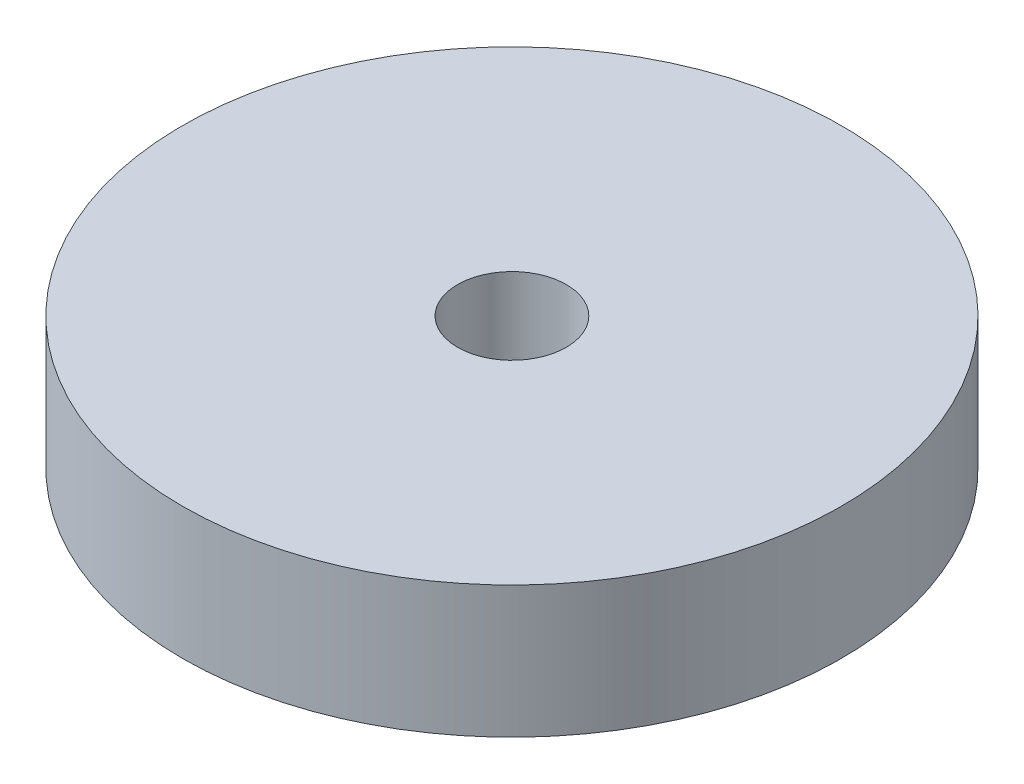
ISO-10303-21;
HEADER;
FILE_DESCRIPTION(('STEP AP214'),'2;1');
FILE_NAME('part.step','',(''),(''),'','','');
FILE_SCHEMA(('AUTOMOTIVE_DESIGN { 1 0 10303 214 1 1 1 1 }'));
ENDSEC;
DATA;
#1=APPLICATION_CONTEXT('core data for automotive mechanical design processes');
#2=APPLICATION_PROTOCOL_DEFINITION('international standard','automotive_design',2000,#1);
#3=PRODUCT_CONTEXT('',#1,'mechanical');
#4=PRODUCT('Part','Part','',(#3));
#5=PRODUCT_RELATED_PRODUCT_CATEGORY('part','',(#4));
#6=PRODUCT_DEFINITION_FORMATION('','',#4);
#7=PRODUCT_DEFINITION_CONTEXT('part definition',#1,'design');
#8=PRODUCT_DEFINITION('design','',#6,#7);
#9=PRODUCT_DEFINITION_SHAPE('','',#8);
#10=(LENGTH_UNIT() NAMED_UNIT(*) SI_UNIT(.MILLI.,.METRE.));
#11=(NAMED_UNIT(*) PLANE_ANGLE_UNIT() SI_UNIT($,.RADIAN.));
#12=(NAMED_UNIT(*) SI_UNIT($,.STERADIAN.) SOLID_ANGLE_UNIT());
#13=UNCERTAINTY_MEASURE_WITH_UNIT(LENGTH_MEASURE(1.E-05),#10,'distance_accuracy_value','');
#14=(GEOMETRIC_REPRESENTATION_CONTEXT(3) GLOBAL_UNCERTAINTY_ASSIGNED_CONTEXT((#13)) GLOBAL_UNIT_ASSIGNED_CONTEXT((#10,
#11,#12)) REPRESENTATION_CONTEXT('',''));
#15=CARTESIAN_POINT('',(0.,0.,0.));
#16=DIRECTION('',(0.,0.,1.));
#17=DIRECTION('',(1.,0.,0.));
#18=AXIS2_PLACEMENT_3D('',#15,#16,#17);
#19=CARTESIAN_POINT('',(0.,4.,0.));
#20=DIRECTION('',(0.,-1.,0.));
#21=DIRECTION('',(0.,0.,-1.));
#22=AXIS2_PLACEMENT_3D('',#19,#20,#21);
#23=CYLINDRICAL_SURFACE('',#22,10.);
#24=CARTESIAN_POINT('',(0.,4.,0.));
#25=DIRECTION('',(0.,1.,0.));
#26=DIRECTION('',(0.,0.,1.));
#27=AXIS2_PLACEMENT_3D('',#24,#25,#26);
#28=CIRCLE('',#27,10.);
#29=CARTESIAN_POINT('',(0.,4.,10.));
#30=VERTEX_POINT('',#29);
#31=EDGE_CURVE('E10',#30,#30,#28,.T.);
#32=ORIENTED_EDGE('',*,*,#31,.F.);
#33=EDGE_LOOP('',(#32));
#34=FACE_BOUND('',#33,.T.);
#35=CARTESIAN_POINT('',(0.,0.,0.));
#36=DIRECTION('',(0.,1.,0.));
#37=DIRECTION('',(0.,0.,1.));
#38=AXIS2_PLACEMENT_3D('',#35,#36,#37);
#39=CIRCLE('',#38,10.);
#40=CARTESIAN_POINT('',(0.,0.,10.));
#41=VERTEX_POINT('',#40);
#42=EDGE_CURVE('E35',#41,#41,#39,.T.);
#43=ORIENTED_EDGE('',*,*,#42,.T.);
#44=EDGE_LOOP('',(#43));
#45=FACE_BOUND('',#44,.T.);
#46=ADVANCED_FACE('F32',(#34,#45),#23,.T.);
#47=CARTESIAN_POINT('',(0.,4.,0.));
#48=DIRECTION('',(0.,1.,0.));
#49=DIRECTION('',(0.,0.,1.));
#50=AXIS2_PLACEMENT_3D('',#47,#48,#49);
#51=PLANE('',#50);
#52=CARTESIAN_POINT('',(0.,4.,0.));
#53=DIRECTION('',(0.,1.,0.));
#54=DIRECTION('',(0.,0.,1.));
#55=AXIS2_PLACEMENT_3D('',#52,#53,#54);
#56=CIRCLE('',#55,1.64999999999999);
#57=CARTESIAN_POINT('',(0.,4.,1.64999999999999));
#58=VERTEX_POINT('',#57);
#59=EDGE_CURVE('E46',#58,#58,#56,.T.);
#60=ORIENTED_EDGE('',*,*,#59,.F.);
#61=EDGE_LOOP('',(#60));
#62=FACE_BOUND('',#61,.T.);
#63=ORIENTED_EDGE('',*,*,#31,.T.);
#64=EDGE_LOOP('',(#63));
#65=FACE_BOUND('',#64,.T.);
#66=ADVANCED_FACE('F52',(#62,#65),#51,.T.);
#67=CARTESIAN_POINT('',(0.,0.,0.));
#68=DIRECTION('',(0.,1.,0.));
#69=DIRECTION('',(0.,0.,1.));
#70=AXIS2_PLACEMENT_3D('',#67,#68,#69);
#71=PLANE('',#70);
#72=CARTESIAN_POINT('',(0.,0.,0.));
#73=DIRECTION('',(0.,1.,0.));
#74=DIRECTION('',(0.,0.,1.));
#75=AXIS2_PLACEMENT_3D('',#72,#73,#74);
#76=CIRCLE('',#75,1.65);
#77=CARTESIAN_POINT('',(0.,0.,1.65));
#78=VERTEX_POINT('',#77);
#79=EDGE_CURVE('E42',#78,#78,#76,.T.);
#80=ORIENTED_EDGE('',*,*,#79,.T.);
#81=EDGE_LOOP('',(#80));
#82=FACE_BOUND('',#81,.T.);
#83=ORIENTED_EDGE('',*,*,#42,.F.);
#84=EDGE_LOOP('',(#83));
#85=FACE_BOUND('',#84,.T.);
#86=ADVANCED_FACE('F54',(#82,#85),#71,.F.);
#87=CARTESIAN_POINT('',(0.,4.,0.));
#88=DIRECTION('',(0.,1.,0.));
#89=DIRECTION('',(0.,0.,1.));
#90=AXIS2_PLACEMENT_3D('',#87,#88,#89);
#91=CYLINDRICAL_SURFACE('',#90,1.64999999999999);
#92=ORIENTED_EDGE('',*,*,#79,.F.);
#93=EDGE_LOOP('',(#92));
#94=FACE_BOUND('',#93,.T.);
#95=ORIENTED_EDGE('',*,*,#59,.T.);
#96=EDGE_LOOP('',(#95));
#97=FACE_BOUND('',#96,.T.);
#98=ADVANCED_FACE('F50',(#94,#97),#91,.F.);
#99=CLOSED_SHELL('',(#46,#66,#86,#98));
#100=MANIFOLD_SOLID_BREP('B2',#99);
#101=ADVANCED_BREP_SHAPE_REPRESENTATION('',(#18,#100),#14);
#102=SHAPE_DEFINITION_REPRESENTATION(#9,#101);
ENDSEC;
END-ISO-10303-21;
